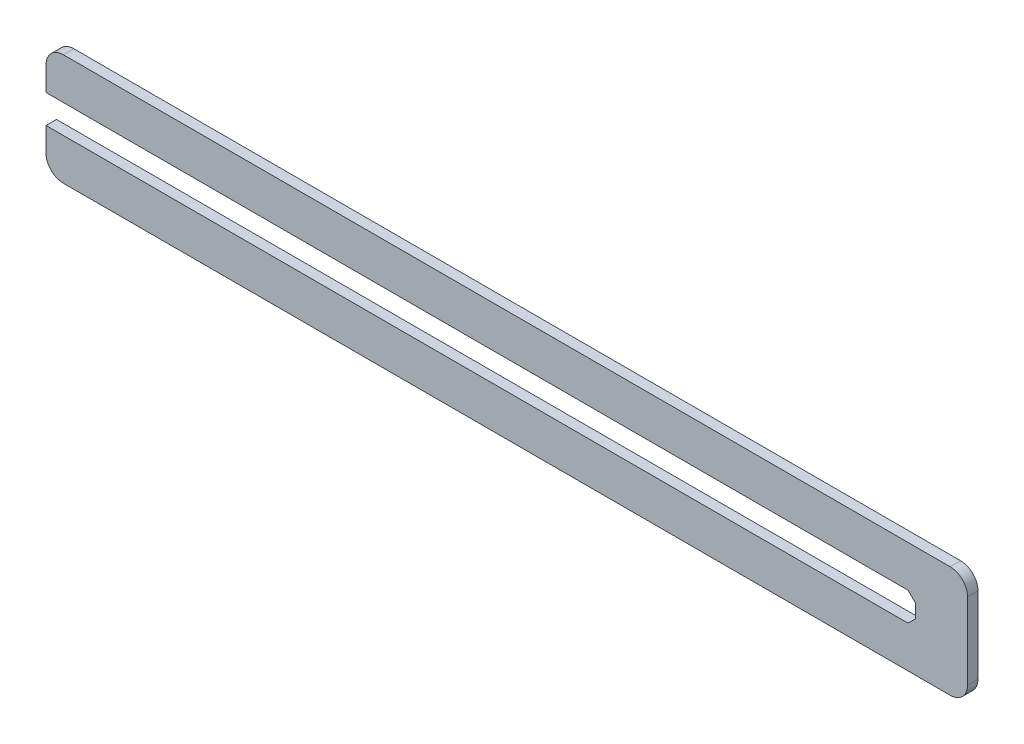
from build123d import *

# Parameters (mm, degrees)
ESQUISSE1_W      = 265
ESQUISSE1_H      = 32
EXTRUSION1_DEPTH = 3
EXTRUSION2_DEPTH = 3
CONG_1_R         = 5


with BuildPart() as part:
    # Esquisse1 → Extrusion1 (new body)
    with BuildSketch(Plane.XY):
        with Locations((132.5, 16)):
            Rectangle(ESQUISSE1_W, ESQUISSE1_H)
    extrude(amount=EXTRUSION1_DEPTH)

    # Esquisse2 → Extrusion2 (cut)
    with BuildSketch(Plane.XY.offset(3)):
        Polygon((0, 20.1), (247.878679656, 20.1), (250, 17.978679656), (250, 14.021320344), (247.878679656, 11.9), (0, 11.9), align=None)
    extrude(amount=-EXTRUSION2_DEPTH, mode=Mode.SUBTRACT)

    # Cong_1
    cong_1_edges = [part.edges().sort_by_distance(p)[0] for p in [
        (0, 32, 1.5),
        (265, 32, 1.5),
        (265, 0, 1.5),
        (0, 0, 1.5),
    ]]
    fillet(cong_1_edges, radius=CONG_1_R)


solid = part.part
